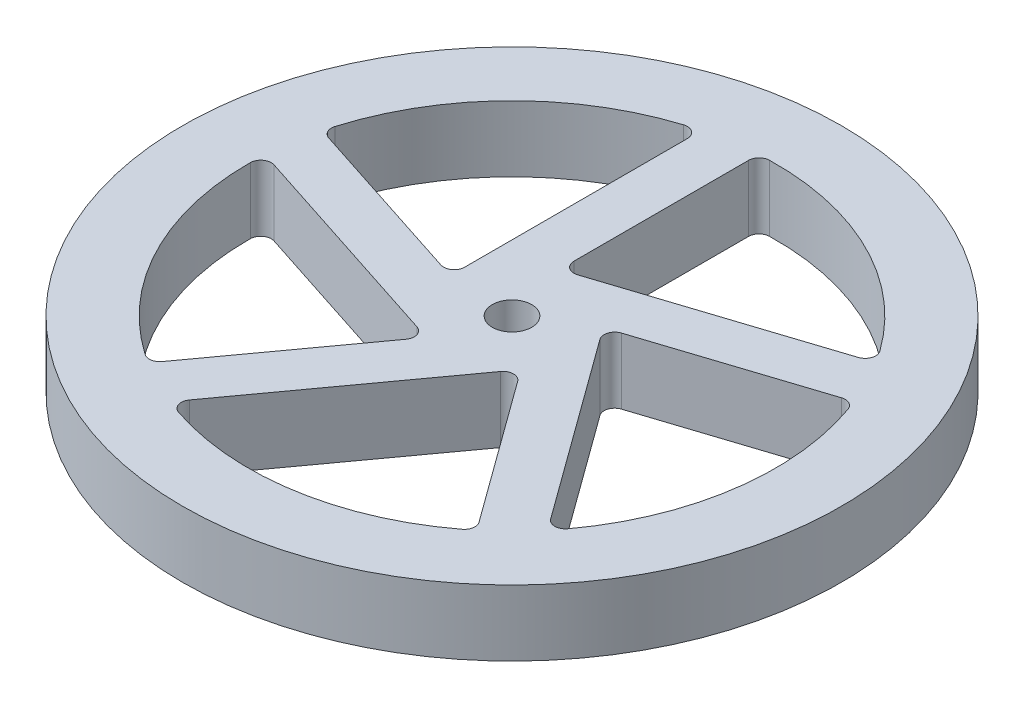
ISO-10303-21;
HEADER;
FILE_DESCRIPTION(('STEP AP214'),'2;1');
FILE_NAME('part.step','',(''),(''),'','','');
FILE_SCHEMA(('AUTOMOTIVE_DESIGN { 1 0 10303 214 1 1 1 1 }'));
ENDSEC;
DATA;
#1=APPLICATION_CONTEXT('core data for automotive mechanical design processes');
#2=APPLICATION_PROTOCOL_DEFINITION('international standard','automotive_design',2000,#1);
#3=PRODUCT_CONTEXT('',#1,'mechanical');
#4=PRODUCT('Part','Part','',(#3));
#5=PRODUCT_RELATED_PRODUCT_CATEGORY('part','',(#4));
#6=PRODUCT_DEFINITION_FORMATION('','',#4);
#7=PRODUCT_DEFINITION_CONTEXT('part definition',#1,'design');
#8=PRODUCT_DEFINITION('design','',#6,#7);
#9=PRODUCT_DEFINITION_SHAPE('','',#8);
#10=(LENGTH_UNIT() NAMED_UNIT(*) SI_UNIT(.MILLI.,.METRE.));
#11=(NAMED_UNIT(*) PLANE_ANGLE_UNIT() SI_UNIT($,.RADIAN.));
#12=(NAMED_UNIT(*) SI_UNIT($,.STERADIAN.) SOLID_ANGLE_UNIT());
#13=UNCERTAINTY_MEASURE_WITH_UNIT(LENGTH_MEASURE(1.E-05),#10,'distance_accuracy_value','');
#14=(GEOMETRIC_REPRESENTATION_CONTEXT(3) GLOBAL_UNCERTAINTY_ASSIGNED_CONTEXT((#13)) GLOBAL_UNIT_ASSIGNED_CONTEXT((#10,
#11,#12)) REPRESENTATION_CONTEXT('',''));
#15=CARTESIAN_POINT('',(0.,0.,0.));
#16=DIRECTION('',(0.,0.,1.));
#17=DIRECTION('',(1.,0.,0.));
#18=AXIS2_PLACEMENT_3D('',#15,#16,#17);
#19=CARTESIAN_POINT('',(0.,3.175,0.));
#20=DIRECTION('',(0.,-1.,0.));
#21=DIRECTION('',(0.,0.,-1.));
#22=AXIS2_PLACEMENT_3D('',#19,#20,#21);
#23=CYLINDRICAL_SURFACE('',#22,31.75);
#24=CARTESIAN_POINT('',(0.,3.175,0.));
#25=DIRECTION('',(0.,1.,0.));
#26=DIRECTION('',(0.,0.,1.));
#27=AXIS2_PLACEMENT_3D('',#24,#25,#26);
#28=CIRCLE('',#27,31.75);
#29=CARTESIAN_POINT('',(0.,3.175,31.75));
#30=VERTEX_POINT('',#29);
#31=EDGE_CURVE('E331',#30,#30,#28,.T.);
#32=ORIENTED_EDGE('',*,*,#31,.F.);
#33=EDGE_LOOP('',(#32));
#34=FACE_BOUND('',#33,.T.);
#35=CARTESIAN_POINT('',(0.,-3.175,0.));
#36=DIRECTION('',(0.,1.,0.));
#37=DIRECTION('',(0.,0.,1.));
#38=AXIS2_PLACEMENT_3D('',#35,#36,#37);
#39=CIRCLE('',#38,31.75);
#40=CARTESIAN_POINT('',(0.,-3.175,31.75));
#41=VERTEX_POINT('',#40);
#42=EDGE_CURVE('E336',#41,#41,#39,.T.);
#43=ORIENTED_EDGE('',*,*,#42,.T.);
#44=EDGE_LOOP('',(#43));
#45=FACE_BOUND('',#44,.T.);
#46=ADVANCED_FACE('F106',(#34,#45),#23,.T.);
#47=CARTESIAN_POINT('',(0.,3.175,0.));
#48=DIRECTION('',(0.,1.,0.));
#49=DIRECTION('',(0.,0.,1.));
#50=AXIS2_PLACEMENT_3D('',#47,#48,#49);
#51=PLANE('',#50);
#52=DIRECTION('',(-0.951056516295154,0.,-0.309016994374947));
#53=VECTOR('',#52,1.);
#54=CARTESIAN_POINT('',(-1.96225791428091,3.175,6.03920887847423));
#55=LINE('',#54,#53);
#56=CARTESIAN_POINT('',(-3.66697709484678,3.175,5.48531204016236));
#57=VERTEX_POINT('',#56);
#58=CARTESIAN_POINT('',(-24.0693922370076,3.175,-1.14383449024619));
#59=VERTEX_POINT('',#58);
#60=EDGE_CURVE('E884',#57,#59,#55,.T.);
#61=ORIENTED_EDGE('',*,*,#60,.F.);
#62=CARTESIAN_POINT('',(-3.98093836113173,3.175,6.45158546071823));
#63=DIRECTION('',(0.,1.,0.));
#64=DIRECTION('',(0.,0.,1.));
#65=AXIS2_PLACEMENT_3D('',#62,#63,#64);
#66=CIRCLE('',#65,1.016);
#67=CARTESIAN_POINT('',(-3.15897709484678,3.175,7.04877527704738));
#68=VERTEX_POINT('',#67);
#69=EDGE_CURVE('E129',#57,#68,#66,.F.);
#70=ORIENTED_EDGE('',*,*,#69,.T.);
#71=DIRECTION('',(-0.587785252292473,0.,0.809016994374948));
#72=VECTOR('',#71,1.);
#73=CARTESIAN_POINT('',(1.28431447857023,3.175,0.9331090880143));
#74=LINE('',#73,#72);
#75=CARTESIAN_POINT('',(-13.0443040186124,3.175,20.6547605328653));
#76=VERTEX_POINT('',#75);
#77=EDGE_CURVE('E883',#68,#76,#74,.T.);
#78=ORIENTED_EDGE('',*,*,#77,.T.);
#79=CARTESIAN_POINT('',(-13.8662652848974,3.175,20.0575707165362));
#80=DIRECTION('',(0.,1.,0.));
#81=DIRECTION('',(0.,0.,1.));
#82=AXIS2_PLACEMENT_3D('',#79,#80,#81);
#83=CIRCLE('',#82,1.016);
#84=CARTESIAN_POINT('',(-14.4440263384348,3.175,20.8933028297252));
#85=VERTEX_POINT('',#84);
#86=EDGE_CURVE('E443',#76,#85,#83,.F.);
#87=ORIENTED_EDGE('',*,*,#86,.T.);
#88=CARTESIAN_POINT('',(0.,3.175,0.));
#89=DIRECTION('',(0.,1.,0.));
#90=DIRECTION('',(0.,0.,1.));
#91=AXIS2_PLACEMENT_3D('',#88,#89,#90);
#92=CIRCLE('',#91,25.4);
#93=CARTESIAN_POINT('',(-25.3993265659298,3.175,-0.184959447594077));
#94=VERTEX_POINT('',#93);
#95=EDGE_CURVE('E879',#94,#85,#92,.T.);
#96=ORIENTED_EDGE('',*,*,#95,.F.);
#97=CARTESIAN_POINT('',(-24.3833535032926,3.175,-0.177561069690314));
#98=DIRECTION('',(0.,1.,0.));
#99=DIRECTION('',(0.,0.,1.));
#100=AXIS2_PLACEMENT_3D('',#97,#98,#99);
#101=CIRCLE('',#100,1.016);
#102=EDGE_CURVE('E121',#94,#59,#101,.F.);
#103=ORIENTED_EDGE('',*,*,#102,.T.);
#104=EDGE_LOOP('',(#61,#70,#78,#87,#96,#103));
#105=FACE_BOUND('',#104,.T.);
#106=DIRECTION('',(-0.587785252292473,0.,0.809016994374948));
#107=VECTOR('',#106,1.);
#108=CARTESIAN_POINT('',(5.13725791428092,3.175,3.7324363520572));
#109=LINE('',#108,#107);
#110=CARTESIAN_POINT('',(4.08368351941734,3.175,5.18255710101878));
#111=VERTEX_POINT('',#110);
#112=CARTESIAN_POINT('',(-8.52570249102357,3.175,22.5378880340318));
#113=VERTEX_POINT('',#112);
#114=EDGE_CURVE('E616',#111,#113,#109,.T.);
#115=ORIENTED_EDGE('',*,*,#114,.F.);
#116=CARTESIAN_POINT('',(4.90564478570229,3.175,5.77974691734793));
#117=DIRECTION('',(0.,1.,0.));
#118=DIRECTION('',(0.,0.,1.));
#119=AXIS2_PLACEMENT_3D('',#116,#117,#118);
#120=CIRCLE('',#119,1.016);
#121=CARTESIAN_POINT('',(5.72760605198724,3.175,5.18255710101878));
#122=VERTEX_POINT('',#121);
#123=EDGE_CURVE('E439',#111,#122,#120,.F.);
#124=ORIENTED_EDGE('',*,*,#123,.T.);
#125=DIRECTION('',(0.587785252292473,0.,0.809016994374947));
#126=VECTOR('',#125,1.);
#127=CARTESIAN_POINT('',(1.28431447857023,3.175,-0.933109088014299));
#128=LINE('',#127,#126);
#129=CARTESIAN_POINT('',(15.6129329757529,3.175,18.7885423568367));
#130=VERTEX_POINT('',#129);
#131=EDGE_CURVE('E606',#122,#130,#128,.T.);
#132=ORIENTED_EDGE('',*,*,#131,.T.);
#133=CARTESIAN_POINT('',(14.7909717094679,3.175,19.3857321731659));
#134=DIRECTION('',(0.,1.,0.));
#135=DIRECTION('',(0.,0.,1.));
#136=AXIS2_PLACEMENT_3D('',#133,#134,#135);
#137=CIRCLE('',#136,1.016);
#138=CARTESIAN_POINT('',(15.4072621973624,3.175,20.1934710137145));
#139=VERTEX_POINT('',#138);
#140=EDGE_CURVE('E453',#130,#139,#137,.F.);
#141=ORIENTED_EDGE('',*,*,#140,.T.);
#142=CARTESIAN_POINT('',(0.,3.175,0.));
#143=DIRECTION('',(0.,1.,0.));
#144=DIRECTION('',(0.,0.,1.));
#145=AXIS2_PLACEMENT_3D('',#142,#143,#144);
#146=CIRCLE('',#145,25.4);
#147=CARTESIAN_POINT('',(-8.02473044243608,3.175,24.0990394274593));
#148=VERTEX_POINT('',#147);
#149=EDGE_CURVE('E610',#148,#139,#146,.T.);
#150=ORIENTED_EDGE('',*,*,#149,.F.);
#151=CARTESIAN_POINT('',(-7.70374122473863,3.175,23.135077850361));
#152=DIRECTION('',(0.,1.,0.));
#153=DIRECTION('',(0.,0.,1.));
#154=AXIS2_PLACEMENT_3D('',#151,#152,#153);
#155=CIRCLE('',#154,1.016);
#156=EDGE_CURVE('E435',#148,#113,#155,.F.);
#157=ORIENTED_EDGE('',*,*,#156,.T.);
#158=EDGE_LOOP('',(#115,#124,#132,#141,#150,#157));
#159=FACE_BOUND('',#158,.T.);
#160=DIRECTION('',(0.587785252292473,0.,0.809016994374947));
#161=VECTOR('',#160,1.);
#162=CARTESIAN_POINT('',(5.13725791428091,3.175,-3.7324363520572));
#163=LINE('',#162,#161);
#164=CARTESIAN_POINT('',(6.19083230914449,3.175,-2.28231560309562));
#165=VERTEX_POINT('',#164);
#166=CARTESIAN_POINT('',(18.8002183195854,3.175,15.0730153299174));
#167=VERTEX_POINT('',#166);
#168=EDGE_CURVE('E622',#165,#167,#163,.T.);
#169=ORIENTED_EDGE('',*,*,#168,.F.);
#170=CARTESIAN_POINT('',(7.01279357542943,3.175,-2.87950541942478));
#171=DIRECTION('',(0.,1.,0.));
#172=DIRECTION('',(0.,0.,1.));
#173=AXIS2_PLACEMENT_3D('',#170,#171,#172);
#174=CIRCLE('',#173,1.016);
#175=CARTESIAN_POINT('',(6.69883230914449,3.175,-3.84577883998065));
#176=VERTEX_POINT('',#175);
#177=EDGE_CURVE('E431',#165,#176,#174,.F.);
#178=ORIENTED_EDGE('',*,*,#177,.T.);
#179=DIRECTION('',(0.951056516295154,0.,-0.309016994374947));
#180=VECTOR('',#179,1.);
#181=CARTESIAN_POINT('',(-0.490564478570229,3.175,-1.50980221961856));
#182=LINE('',#181,#180);
#183=CARTESIAN_POINT('',(22.6936272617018,3.175,-9.04280275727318));
#184=VERTEX_POINT('',#183);
#185=EDGE_CURVE('E627',#176,#184,#182,.T.);
#186=ORIENTED_EDGE('',*,*,#185,.T.);
#187=CARTESIAN_POINT('',(23.0075885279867,3.175,-8.0765293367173));
#188=DIRECTION('',(0.,1.,0.));
#189=DIRECTION('',(0.,0.,1.));
#190=AXIS2_PLACEMENT_3D('',#187,#188,#189);
#191=CIRCLE('',#190,1.016);
#192=CARTESIAN_POINT('',(23.9662380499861,3.175,-8.41305139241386));
#193=VERTEX_POINT('',#192);
#194=EDGE_CURVE('E423',#184,#193,#191,.F.);
#195=ORIENTED_EDGE('',*,*,#194,.T.);
#196=CARTESIAN_POINT('',(0.,3.175,0.));
#197=DIRECTION('',(0.,1.,0.));
#198=DIRECTION('',(0.,0.,1.));
#199=AXIS2_PLACEMENT_3D('',#196,#197,#198);
#200=CIRCLE('',#199,25.4);
#201=CARTESIAN_POINT('',(20.4397704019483,3.175,15.0789849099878));
#202=VERTEX_POINT('',#201);
#203=EDGE_CURVE('E632',#202,#193,#200,.T.);
#204=ORIENTED_EDGE('',*,*,#203,.F.);
#205=CARTESIAN_POINT('',(19.6221795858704,3.175,14.4758255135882));
#206=DIRECTION('',(0.,1.,0.));
#207=DIRECTION('',(0.,0.,1.));
#208=AXIS2_PLACEMENT_3D('',#205,#206,#207);
#209=CIRCLE('',#208,1.016);
#210=EDGE_CURVE('E427',#202,#167,#209,.F.);
#211=ORIENTED_EDGE('',*,*,#210,.T.);
#212=EDGE_LOOP('',(#169,#178,#186,#195,#204,#211));
#213=FACE_BOUND('',#212,.T.);
#214=DIRECTION('',(0.951056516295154,0.,-0.309016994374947));
#215=VECTOR('',#214,1.);
#216=CARTESIAN_POINT('',(-1.96225791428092,3.175,-6.03920887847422));
#217=LINE('',#216,#215);
#218=CARTESIAN_POINT('',(-0.257538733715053,3.175,-6.59310571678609));
#219=VERTEX_POINT('',#218);
#220=CARTESIAN_POINT('',(20.1448764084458,3.175,-13.2222522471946));
#221=VERTEX_POINT('',#220);
#222=EDGE_CURVE('E460',#219,#221,#217,.T.);
#223=ORIENTED_EDGE('',*,*,#222,.F.);
#224=CARTESIAN_POINT('',(-0.5715,3.175,-7.55937913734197));
#225=DIRECTION('',(0.,1.,0.));
#226=DIRECTION('',(0.,0.,1.));
#227=AXIS2_PLACEMENT_3D('',#224,#225,#226);
#228=CIRCLE('',#227,1.016);
#229=CARTESIAN_POINT('',(-1.5875,3.175,-7.55937913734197));
#230=VERTEX_POINT('',#229);
#231=EDGE_CURVE('E419',#219,#230,#228,.F.);
#232=ORIENTED_EDGE('',*,*,#231,.T.);
#233=DIRECTION('',(0.,0.,-1.));
#234=VECTOR('',#233,1.);
#235=CARTESIAN_POINT('',(-1.5875,3.175,0.));
#236=LINE('',#235,#234);
#237=CARTESIAN_POINT('',(-1.5875,3.175,-24.3773018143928));
#238=VERTEX_POINT('',#237);
#239=EDGE_CURVE('E491',#230,#238,#236,.T.);
#240=ORIENTED_EDGE('',*,*,#239,.T.);
#241=CARTESIAN_POINT('',(-0.5715,3.175,-24.3773018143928));
#242=DIRECTION('',(0.,1.,0.));
#243=DIRECTION('',(0.,0.,1.));
#244=AXIS2_PLACEMENT_3D('',#241,#242,#243);
#245=CIRCLE('',#244,1.016);
#246=CARTESIAN_POINT('',(-0.595312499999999,3.175,-25.3930227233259));
#247=VERTEX_POINT('',#246);
#248=EDGE_CURVE('E415',#238,#247,#245,.F.);
#249=ORIENTED_EDGE('',*,*,#248,.T.);
#250=CARTESIAN_POINT('',(0.,3.175,0.));
#251=DIRECTION('',(0.,1.,0.));
#252=DIRECTION('',(0.,0.,1.));
#253=AXIS2_PLACEMENT_3D('',#250,#251,#252);
#254=CIRCLE('',#253,25.4);
#255=CARTESIAN_POINT('',(20.6572032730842,3.175,-14.7797142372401));
#256=VERTEX_POINT('',#255);
#257=EDGE_CURVE('E462',#256,#247,#254,.T.);
#258=ORIENTED_EDGE('',*,*,#257,.F.);
#259=CARTESIAN_POINT('',(19.8309151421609,3.175,-14.1885256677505));
#260=DIRECTION('',(0.,1.,0.));
#261=DIRECTION('',(0.,0.,1.));
#262=AXIS2_PLACEMENT_3D('',#259,#260,#261);
#263=CIRCLE('',#262,1.016);
#264=EDGE_CURVE('E114',#256,#221,#263,.F.);
#265=ORIENTED_EDGE('',*,*,#264,.T.);
#266=EDGE_LOOP('',(#223,#232,#240,#249,#258,#265));
#267=FACE_BOUND('',#266,.T.);
#268=DIRECTION('',(0.,0.,-1.));
#269=VECTOR('',#268,1.);
#270=CARTESIAN_POINT('',(-6.35,3.175,0.));
#271=LINE('',#270,#269);
#272=CARTESIAN_POINT('',(-6.35,3.175,-1.79244782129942));
#273=VERTEX_POINT('',#272);
#274=CARTESIAN_POINT('',(-6.35,3.175,-23.2448166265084));
#275=VERTEX_POINT('',#274);
#276=EDGE_CURVE('E310',#273,#275,#271,.T.);
#277=ORIENTED_EDGE('',*,*,#276,.F.);
#278=CARTESIAN_POINT('',(-7.366,3.175,-1.79244782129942));
#279=DIRECTION('',(0.,1.,0.));
#280=DIRECTION('',(0.,0.,1.));
#281=AXIS2_PLACEMENT_3D('',#278,#279,#280);
#282=CIRCLE('',#281,1.016);
#283=CARTESIAN_POINT('',(-7.67996126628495,3.175,-0.82617440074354));
#284=VERTEX_POINT('',#283);
#285=EDGE_CURVE('E304',#273,#284,#282,.F.);
#286=ORIENTED_EDGE('',*,*,#285,.T.);
#287=DIRECTION('',(-0.951056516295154,0.,-0.309016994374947));
#288=VECTOR('',#287,1.);
#289=CARTESIAN_POINT('',(-0.490564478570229,3.175,1.50980221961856));
#290=LINE('',#289,#288);
#291=CARTESIAN_POINT('',(-23.6747562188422,3.175,-6.02319831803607));
#292=VERTEX_POINT('',#291);
#293=EDGE_CURVE('E308',#284,#292,#290,.T.);
#294=ORIENTED_EDGE('',*,*,#293,.T.);
#295=CARTESIAN_POINT('',(-23.3607949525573,3.175,-6.98947173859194));
#296=DIRECTION('',(0.,1.,0.));
#297=DIRECTION('',(0.,0.,1.));
#298=AXIS2_PLACEMENT_3D('',#295,#296,#297);
#299=CIRCLE('',#298,1.016);
#300=CARTESIAN_POINT('',(-24.3341614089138,3.175,-7.28069972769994));
#301=VERTEX_POINT('',#300);
#302=EDGE_CURVE('E407',#292,#301,#299,.F.);
#303=ORIENTED_EDGE('',*,*,#302,.T.);
#304=CARTESIAN_POINT('',(0.,3.175,0.));
#305=DIRECTION('',(0.,1.,0.));
#306=DIRECTION('',(0.,0.,1.));
#307=AXIS2_PLACEMENT_3D('',#304,#305,#306);
#308=CIRCLE('',#307,25.4);
#309=CARTESIAN_POINT('',(-7.67291666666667,3.175,-24.2133506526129));
#310=VERTEX_POINT('',#309);
#311=EDGE_CURVE('E327',#310,#301,#308,.T.);
#312=ORIENTED_EDGE('',*,*,#311,.F.);
#313=CARTESIAN_POINT('',(-7.366,3.175,-23.2448166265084));
#314=DIRECTION('',(0.,1.,0.));
#315=DIRECTION('',(0.,0.,1.));
#316=AXIS2_PLACEMENT_3D('',#313,#314,#315);
#317=CIRCLE('',#316,1.016);
#318=EDGE_CURVE('E411',#310,#275,#317,.F.);
#319=ORIENTED_EDGE('',*,*,#318,.T.);
#320=EDGE_LOOP('',(#277,#286,#294,#303,#312,#319));
#321=FACE_BOUND('',#320,.T.);
#322=CARTESIAN_POINT('',(0.,3.175,0.));
#323=DIRECTION('',(0.,1.,0.));
#324=DIRECTION('',(0.,0.,1.));
#325=AXIS2_PLACEMENT_3D('',#322,#323,#324);
#326=CIRCLE('',#325,1.89864999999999);
#327=CARTESIAN_POINT('',(0.,3.175,1.89864999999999));
#328=VERTEX_POINT('',#327);
#329=EDGE_CURVE('E502',#328,#328,#326,.T.);
#330=ORIENTED_EDGE('',*,*,#329,.F.);
#331=EDGE_LOOP('',(#330));
#332=FACE_BOUND('',#331,.T.);
#333=ORIENTED_EDGE('',*,*,#31,.T.);
#334=EDGE_LOOP('',(#333));
#335=FACE_BOUND('',#334,.T.);
#336=ADVANCED_FACE('F306',(#105,#159,#213,#267,#321,#332,#335),#51,.T.);
#337=CARTESIAN_POINT('',(0.,-3.175,0.));
#338=DIRECTION('',(0.,1.,0.));
#339=DIRECTION('',(0.,0.,1.));
#340=AXIS2_PLACEMENT_3D('',#337,#338,#339);
#341=PLANE('',#340);
#342=CARTESIAN_POINT('',(0.,-3.175,0.));
#343=DIRECTION('',(0.,1.,0.));
#344=DIRECTION('',(0.,0.,1.));
#345=AXIS2_PLACEMENT_3D('',#342,#343,#344);
#346=CIRCLE('',#345,25.4);
#347=CARTESIAN_POINT('',(-14.4440263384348,-3.175,20.8933028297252));
#348=VERTEX_POINT('',#347);
#349=CARTESIAN_POINT('',(-25.3993265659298,-3.175,-0.184959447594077));
#350=VERTEX_POINT('',#349);
#351=EDGE_CURVE('E613',#348,#350,#346,.F.);
#352=ORIENTED_EDGE('',*,*,#351,.F.);
#353=CARTESIAN_POINT('',(-13.8662652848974,-3.175,20.0575707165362));
#354=DIRECTION('',(0.,1.,0.));
#355=DIRECTION('',(0.,0.,1.));
#356=AXIS2_PLACEMENT_3D('',#353,#354,#355);
#357=CIRCLE('',#356,1.016);
#358=CARTESIAN_POINT('',(-13.0443040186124,-3.175,20.6547605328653));
#359=VERTEX_POINT('',#358);
#360=EDGE_CURVE('E445',#348,#359,#357,.T.);
#361=ORIENTED_EDGE('',*,*,#360,.T.);
#362=DIRECTION('',(0.587785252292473,0.,-0.809016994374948));
#363=VECTOR('',#362,1.);
#364=CARTESIAN_POINT('',(1.28431447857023,-3.175,0.9331090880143));
#365=LINE('',#364,#363);
#366=CARTESIAN_POINT('',(-3.15897709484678,-3.175,7.04877527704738));
#367=VERTEX_POINT('',#366);
#368=EDGE_CURVE('E890',#359,#367,#365,.T.);
#369=ORIENTED_EDGE('',*,*,#368,.T.);
#370=CARTESIAN_POINT('',(-3.98093836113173,-3.175,6.45158546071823));
#371=DIRECTION('',(0.,1.,0.));
#372=DIRECTION('',(0.,0.,1.));
#373=AXIS2_PLACEMENT_3D('',#370,#371,#372);
#374=CIRCLE('',#373,1.016);
#375=CARTESIAN_POINT('',(-3.66697709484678,-3.175,5.48531204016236));
#376=VERTEX_POINT('',#375);
#377=EDGE_CURVE('E451',#367,#376,#374,.T.);
#378=ORIENTED_EDGE('',*,*,#377,.T.);
#379=DIRECTION('',(0.951056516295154,0.,0.309016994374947));
#380=VECTOR('',#379,1.);
#381=CARTESIAN_POINT('',(-1.96225791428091,-3.175,6.03920887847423));
#382=LINE('',#381,#380);
#383=CARTESIAN_POINT('',(-24.0693922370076,-3.175,-1.14383449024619));
#384=VERTEX_POINT('',#383);
#385=EDGE_CURVE('E894',#384,#376,#382,.T.);
#386=ORIENTED_EDGE('',*,*,#385,.F.);
#387=CARTESIAN_POINT('',(-24.3833535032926,-3.175,-0.177561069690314));
#388=DIRECTION('',(0.,1.,0.));
#389=DIRECTION('',(0.,0.,1.));
#390=AXIS2_PLACEMENT_3D('',#387,#388,#389);
#391=CIRCLE('',#390,1.016);
#392=EDGE_CURVE('E448',#384,#350,#391,.T.);
#393=ORIENTED_EDGE('',*,*,#392,.T.);
#394=EDGE_LOOP('',(#352,#361,#369,#378,#386,#393));
#395=FACE_BOUND('',#394,.T.);
#396=CARTESIAN_POINT('',(0.,-3.175,0.));
#397=DIRECTION('',(0.,1.,0.));
#398=DIRECTION('',(0.,0.,1.));
#399=AXIS2_PLACEMENT_3D('',#396,#397,#398);
#400=CIRCLE('',#399,25.4);
#401=CARTESIAN_POINT('',(15.4072621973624,-3.175,20.1934710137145));
#402=VERTEX_POINT('',#401);
#403=CARTESIAN_POINT('',(-8.02473044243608,-3.175,24.0990394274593));
#404=VERTEX_POINT('',#403);
#405=EDGE_CURVE('E599',#402,#404,#400,.F.);
#406=ORIENTED_EDGE('',*,*,#405,.F.);
#407=CARTESIAN_POINT('',(14.7909717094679,-3.175,19.3857321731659));
#408=DIRECTION('',(0.,1.,0.));
#409=DIRECTION('',(0.,0.,1.));
#410=AXIS2_PLACEMENT_3D('',#407,#408,#409);
#411=CIRCLE('',#410,1.016);
#412=CARTESIAN_POINT('',(15.6129329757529,-3.175,18.7885423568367));
#413=VERTEX_POINT('',#412);
#414=EDGE_CURVE('E455',#402,#413,#411,.T.);
#415=ORIENTED_EDGE('',*,*,#414,.T.);
#416=DIRECTION('',(-0.587785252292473,0.,-0.809016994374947));
#417=VECTOR('',#416,1.);
#418=CARTESIAN_POINT('',(1.28431447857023,-3.175,-0.933109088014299));
#419=LINE('',#418,#417);
#420=CARTESIAN_POINT('',(5.72760605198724,-3.175,5.18255710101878));
#421=VERTEX_POINT('',#420);
#422=EDGE_CURVE('E596',#413,#421,#419,.T.);
#423=ORIENTED_EDGE('',*,*,#422,.T.);
#424=CARTESIAN_POINT('',(4.90564478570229,-3.175,5.77974691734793));
#425=DIRECTION('',(0.,1.,0.));
#426=DIRECTION('',(0.,0.,1.));
#427=AXIS2_PLACEMENT_3D('',#424,#425,#426);
#428=CIRCLE('',#427,1.016);
#429=CARTESIAN_POINT('',(4.08368351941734,-3.175,5.18255710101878));
#430=VERTEX_POINT('',#429);
#431=EDGE_CURVE('E441',#421,#430,#428,.T.);
#432=ORIENTED_EDGE('',*,*,#431,.T.);
#433=DIRECTION('',(0.587785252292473,0.,-0.809016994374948));
#434=VECTOR('',#433,1.);
#435=CARTESIAN_POINT('',(5.13725791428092,-3.175,3.7324363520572));
#436=LINE('',#435,#434);
#437=CARTESIAN_POINT('',(-8.52570249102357,-3.175,22.5378880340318));
#438=VERTEX_POINT('',#437);
#439=EDGE_CURVE('E605',#438,#430,#436,.T.);
#440=ORIENTED_EDGE('',*,*,#439,.F.);
#441=CARTESIAN_POINT('',(-7.70374122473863,-3.175,23.135077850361));
#442=DIRECTION('',(0.,1.,0.));
#443=DIRECTION('',(0.,0.,1.));
#444=AXIS2_PLACEMENT_3D('',#441,#442,#443);
#445=CIRCLE('',#444,1.016);
#446=EDGE_CURVE('E437',#438,#404,#445,.T.);
#447=ORIENTED_EDGE('',*,*,#446,.T.);
#448=EDGE_LOOP('',(#406,#415,#423,#432,#440,#447));
#449=FACE_BOUND('',#448,.T.);
#450=CARTESIAN_POINT('',(0.,-3.175,0.));
#451=DIRECTION('',(0.,1.,0.));
#452=DIRECTION('',(0.,0.,1.));
#453=AXIS2_PLACEMENT_3D('',#450,#451,#452);
#454=CIRCLE('',#453,25.4);
#455=CARTESIAN_POINT('',(23.9662380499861,-3.175,-8.41305139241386));
#456=VERTEX_POINT('',#455);
#457=CARTESIAN_POINT('',(20.4397704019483,-3.175,15.0789849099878));
#458=VERTEX_POINT('',#457);
#459=EDGE_CURVE('E471',#456,#458,#454,.F.);
#460=ORIENTED_EDGE('',*,*,#459,.F.);
#461=CARTESIAN_POINT('',(23.0075885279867,-3.175,-8.0765293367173));
#462=DIRECTION('',(0.,1.,0.));
#463=DIRECTION('',(0.,0.,1.));
#464=AXIS2_PLACEMENT_3D('',#461,#462,#463);
#465=CIRCLE('',#464,1.016);
#466=CARTESIAN_POINT('',(22.6936272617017,-3.175,-9.04280275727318));
#467=VERTEX_POINT('',#466);
#468=EDGE_CURVE('E425',#456,#467,#465,.T.);
#469=ORIENTED_EDGE('',*,*,#468,.T.);
#470=DIRECTION('',(-0.951056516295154,0.,0.309016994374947));
#471=VECTOR('',#470,1.);
#472=CARTESIAN_POINT('',(-0.490564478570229,-3.175,-1.50980221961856));
#473=LINE('',#472,#471);
#474=CARTESIAN_POINT('',(6.69883230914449,-3.175,-3.84577883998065));
#475=VERTEX_POINT('',#474);
#476=EDGE_CURVE('E623',#467,#475,#473,.T.);
#477=ORIENTED_EDGE('',*,*,#476,.T.);
#478=CARTESIAN_POINT('',(7.01279357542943,-3.175,-2.87950541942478));
#479=DIRECTION('',(0.,1.,0.));
#480=DIRECTION('',(0.,0.,1.));
#481=AXIS2_PLACEMENT_3D('',#478,#479,#480);
#482=CIRCLE('',#481,1.016);
#483=CARTESIAN_POINT('',(6.19083230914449,-3.175,-2.28231560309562));
#484=VERTEX_POINT('',#483);
#485=EDGE_CURVE('E433',#475,#484,#482,.T.);
#486=ORIENTED_EDGE('',*,*,#485,.T.);
#487=DIRECTION('',(-0.587785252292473,0.,-0.809016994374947));
#488=VECTOR('',#487,1.);
#489=CARTESIAN_POINT('',(5.13725791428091,-3.175,-3.7324363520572));
#490=LINE('',#489,#488);
#491=CARTESIAN_POINT('',(18.8002183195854,-3.175,15.0730153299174));
#492=VERTEX_POINT('',#491);
#493=EDGE_CURVE('E626',#492,#484,#490,.T.);
#494=ORIENTED_EDGE('',*,*,#493,.F.);
#495=CARTESIAN_POINT('',(19.6221795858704,-3.175,14.4758255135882));
#496=DIRECTION('',(0.,1.,0.));
#497=DIRECTION('',(0.,0.,1.));
#498=AXIS2_PLACEMENT_3D('',#495,#496,#497);
#499=CIRCLE('',#498,1.016);
#500=EDGE_CURVE('E429',#492,#458,#499,.T.);
#501=ORIENTED_EDGE('',*,*,#500,.T.);
#502=EDGE_LOOP('',(#460,#469,#477,#486,#494,#501));
#503=FACE_BOUND('',#502,.T.);
#504=CARTESIAN_POINT('',(0.,-3.175,0.));
#505=DIRECTION('',(0.,1.,0.));
#506=DIRECTION('',(0.,0.,1.));
#507=AXIS2_PLACEMENT_3D('',#504,#505,#506);
#508=CIRCLE('',#507,25.4);
#509=CARTESIAN_POINT('',(-0.595312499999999,-3.175,-25.3930227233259));
#510=VERTEX_POINT('',#509);
#511=CARTESIAN_POINT('',(20.6572032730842,-3.175,-14.7797142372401));
#512=VERTEX_POINT('',#511);
#513=EDGE_CURVE('E479',#510,#512,#508,.F.);
#514=ORIENTED_EDGE('',*,*,#513,.F.);
#515=CARTESIAN_POINT('',(-0.5715,-3.175,-24.3773018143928));
#516=DIRECTION('',(0.,1.,0.));
#517=DIRECTION('',(0.,0.,1.));
#518=AXIS2_PLACEMENT_3D('',#515,#516,#517);
#519=CIRCLE('',#518,1.016);
#520=CARTESIAN_POINT('',(-1.5875,-3.175,-24.3773018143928));
#521=VERTEX_POINT('',#520);
#522=EDGE_CURVE('E417',#510,#521,#519,.T.);
#523=ORIENTED_EDGE('',*,*,#522,.T.);
#524=DIRECTION('',(0.,0.,1.));
#525=VECTOR('',#524,1.);
#526=CARTESIAN_POINT('',(-1.5875,-3.175,0.));
#527=LINE('',#526,#525);
#528=CARTESIAN_POINT('',(-1.5875,-3.175,-7.55937913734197));
#529=VERTEX_POINT('',#528);
#530=EDGE_CURVE('E487',#521,#529,#527,.T.);
#531=ORIENTED_EDGE('',*,*,#530,.T.);
#532=CARTESIAN_POINT('',(-0.5715,-3.175,-7.55937913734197));
#533=DIRECTION('',(0.,1.,0.));
#534=DIRECTION('',(0.,0.,1.));
#535=AXIS2_PLACEMENT_3D('',#532,#533,#534);
#536=CIRCLE('',#535,1.016);
#537=CARTESIAN_POINT('',(-0.257538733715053,-3.175,-6.59310571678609));
#538=VERTEX_POINT('',#537);
#539=EDGE_CURVE('E421',#529,#538,#536,.T.);
#540=ORIENTED_EDGE('',*,*,#539,.T.);
#541=DIRECTION('',(-0.951056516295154,0.,0.309016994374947));
#542=VECTOR('',#541,1.);
#543=CARTESIAN_POINT('',(-1.96225791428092,-3.175,-6.03920887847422));
#544=LINE('',#543,#542);
#545=CARTESIAN_POINT('',(20.1448764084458,-3.175,-13.2222522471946));
#546=VERTEX_POINT('',#545);
#547=EDGE_CURVE('E481',#546,#538,#544,.T.);
#548=ORIENTED_EDGE('',*,*,#547,.F.);
#549=CARTESIAN_POINT('',(19.8309151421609,-3.175,-14.1885256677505));
#550=DIRECTION('',(0.,1.,0.));
#551=DIRECTION('',(0.,0.,1.));
#552=AXIS2_PLACEMENT_3D('',#549,#550,#551);
#553=CIRCLE('',#552,1.016);
#554=EDGE_CURVE('E12',#546,#512,#553,.T.);
#555=ORIENTED_EDGE('',*,*,#554,.T.);
#556=EDGE_LOOP('',(#514,#523,#531,#540,#548,#555));
#557=FACE_BOUND('',#556,.T.);
#558=CARTESIAN_POINT('',(0.,-3.175,0.));
#559=DIRECTION('',(0.,1.,0.));
#560=DIRECTION('',(0.,0.,1.));
#561=AXIS2_PLACEMENT_3D('',#558,#559,#560);
#562=CIRCLE('',#561,25.4);
#563=CARTESIAN_POINT('',(-24.3341614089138,-3.175,-7.28069972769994));
#564=VERTEX_POINT('',#563);
#565=CARTESIAN_POINT('',(-7.67291666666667,-3.175,-24.2133506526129));
#566=VERTEX_POINT('',#565);
#567=EDGE_CURVE('E496',#564,#566,#562,.F.);
#568=ORIENTED_EDGE('',*,*,#567,.F.);
#569=CARTESIAN_POINT('',(-23.3607949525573,-3.175,-6.98947173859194));
#570=DIRECTION('',(0.,1.,0.));
#571=DIRECTION('',(0.,0.,1.));
#572=AXIS2_PLACEMENT_3D('',#569,#570,#571);
#573=CIRCLE('',#572,1.016);
#574=CARTESIAN_POINT('',(-23.6747562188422,-3.175,-6.02319831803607));
#575=VERTEX_POINT('',#574);
#576=EDGE_CURVE('E409',#564,#575,#573,.T.);
#577=ORIENTED_EDGE('',*,*,#576,.T.);
#578=DIRECTION('',(0.951056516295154,0.,0.309016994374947));
#579=VECTOR('',#578,1.);
#580=CARTESIAN_POINT('',(-0.490564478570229,-3.175,1.50980221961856));
#581=LINE('',#580,#579);
#582=CARTESIAN_POINT('',(-7.67996126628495,-3.175,-0.826174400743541));
#583=VERTEX_POINT('',#582);
#584=EDGE_CURVE('E326',#575,#583,#581,.T.);
#585=ORIENTED_EDGE('',*,*,#584,.T.);
#586=CARTESIAN_POINT('',(-7.366,-3.175,-1.79244782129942));
#587=DIRECTION('',(0.,1.,0.));
#588=DIRECTION('',(0.,0.,1.));
#589=AXIS2_PLACEMENT_3D('',#586,#587,#588);
#590=CIRCLE('',#589,1.016);
#591=CARTESIAN_POINT('',(-6.35,-3.175,-1.79244782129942));
#592=VERTEX_POINT('',#591);
#593=EDGE_CURVE('E315',#583,#592,#590,.T.);
#594=ORIENTED_EDGE('',*,*,#593,.T.);
#595=DIRECTION('',(0.,0.,1.));
#596=VECTOR('',#595,1.);
#597=CARTESIAN_POINT('',(-6.35,-3.175,0.));
#598=LINE('',#597,#596);
#599=CARTESIAN_POINT('',(-6.35,-3.175,-23.2448166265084));
#600=VERTEX_POINT('',#599);
#601=EDGE_CURVE('E494',#600,#592,#598,.T.);
#602=ORIENTED_EDGE('',*,*,#601,.F.);
#603=CARTESIAN_POINT('',(-7.366,-3.175,-23.2448166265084));
#604=DIRECTION('',(0.,1.,0.));
#605=DIRECTION('',(0.,0.,1.));
#606=AXIS2_PLACEMENT_3D('',#603,#604,#605);
#607=CIRCLE('',#606,1.016);
#608=EDGE_CURVE('E316',#600,#566,#607,.T.);
#609=ORIENTED_EDGE('',*,*,#608,.T.);
#610=EDGE_LOOP('',(#568,#577,#585,#594,#602,#609));
#611=FACE_BOUND('',#610,.T.);
#612=CARTESIAN_POINT('',(0.,-3.175,0.));
#613=DIRECTION('',(0.,1.,0.));
#614=DIRECTION('',(0.,0.,1.));
#615=AXIS2_PLACEMENT_3D('',#612,#613,#614);
#616=CIRCLE('',#615,1.89864999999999);
#617=CARTESIAN_POINT('',(0.,-3.175,1.89864999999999));
#618=VERTEX_POINT('',#617);
#619=EDGE_CURVE('E505',#618,#618,#616,.T.);
#620=ORIENTED_EDGE('',*,*,#619,.T.);
#621=EDGE_LOOP('',(#620));
#622=FACE_BOUND('',#621,.T.);
#623=ORIENTED_EDGE('',*,*,#42,.F.);
#624=EDGE_LOOP('',(#623));
#625=FACE_BOUND('',#624,.T.);
#626=ADVANCED_FACE('F477',(#395,#449,#503,#557,#611,#622,#625),#341,.F.);
#627=CARTESIAN_POINT('',(0.,3.175,0.));
#628=DIRECTION('',(0.,1.,0.));
#629=DIRECTION('',(0.,0.,1.));
#630=AXIS2_PLACEMENT_3D('',#627,#628,#629);
#631=CYLINDRICAL_SURFACE('',#630,1.89864999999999);
#632=ORIENTED_EDGE('',*,*,#619,.F.);
#633=EDGE_LOOP('',(#632));
#634=FACE_BOUND('',#633,.T.);
#635=ORIENTED_EDGE('',*,*,#329,.T.);
#636=EDGE_LOOP('',(#635));
#637=FACE_BOUND('',#636,.T.);
#638=ADVANCED_FACE('F514',(#634,#637),#631,.F.);
#639=CARTESIAN_POINT('',(-6.35,-36.434395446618,0.));
#640=DIRECTION('',(1.,0.,0.));
#641=DIRECTION('',(0.,0.,-1.));
#642=AXIS2_PLACEMENT_3D('',#639,#640,#641);
#643=PLANE('',#642);
#644=ORIENTED_EDGE('',*,*,#276,.T.);
#645=DIRECTION('',(0.,-1.,0.));
#646=VECTOR('',#645,1.);
#647=CARTESIAN_POINT('',(-6.35,-3.175,-23.2448166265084));
#648=LINE('',#647,#646);
#649=EDGE_CURVE('E346',#275,#600,#648,.T.);
#650=ORIENTED_EDGE('',*,*,#649,.T.);
#651=ORIENTED_EDGE('',*,*,#601,.T.);
#652=DIRECTION('',(0.,1.,0.));
#653=VECTOR('',#652,1.);
#654=CARTESIAN_POINT('',(-6.35,-36.434395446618,-1.79244782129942));
#655=LINE('',#654,#653);
#656=EDGE_CURVE('E344',#592,#273,#655,.T.);
#657=ORIENTED_EDGE('',*,*,#656,.T.);
#658=EDGE_LOOP('',(#644,#650,#651,#657));
#659=FACE_BOUND('',#658,.T.);
#660=ADVANCED_FACE('F521',(#659),#643,.F.);
#661=CARTESIAN_POINT('',(-0.490564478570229,-36.434395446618,1.50980221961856));
#662=DIRECTION('',(0.309016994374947,0.,-0.951056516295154));
#663=DIRECTION('',(-0.951056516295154,0.,-0.309016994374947));
#664=AXIS2_PLACEMENT_3D('',#661,#662,#663);
#665=PLANE('',#664);
#666=ORIENTED_EDGE('',*,*,#584,.F.);
#667=DIRECTION('',(0.,1.,0.));
#668=VECTOR('',#667,1.);
#669=CARTESIAN_POINT('',(-23.6747562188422,-36.434395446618,-6.02319831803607));
#670=LINE('',#669,#668);
#671=EDGE_CURVE('E325',#575,#292,#670,.T.);
#672=ORIENTED_EDGE('',*,*,#671,.T.);
#673=ORIENTED_EDGE('',*,*,#293,.F.);
#674=DIRECTION('',(0.,1.,0.));
#675=VECTOR('',#674,1.);
#676=CARTESIAN_POINT('',(-7.67996126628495,-36.434395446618,-0.826174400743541));
#677=LINE('',#676,#675);
#678=EDGE_CURVE('E322',#284,#583,#677,.F.);
#679=ORIENTED_EDGE('',*,*,#678,.T.);
#680=EDGE_LOOP('',(#666,#672,#673,#679));
#681=FACE_BOUND('',#680,.T.);
#682=ADVANCED_FACE('F321',(#681),#665,.T.);
#683=CARTESIAN_POINT('',(0.,-36.434395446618,0.));
#684=DIRECTION('',(0.,1.,0.));
#685=DIRECTION('',(0.,0.,1.));
#686=AXIS2_PLACEMENT_3D('',#683,#684,#685);
#687=CYLINDRICAL_SURFACE('',#686,25.4);
#688=ORIENTED_EDGE('',*,*,#311,.T.);
#689=DIRECTION('',(0.,1.,0.));
#690=VECTOR('',#689,1.);
#691=CARTESIAN_POINT('',(-24.3341614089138,-36.434395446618,-7.28069972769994));
#692=LINE('',#691,#690);
#693=EDGE_CURVE('E342',#301,#564,#692,.F.);
#694=ORIENTED_EDGE('',*,*,#693,.T.);
#695=ORIENTED_EDGE('',*,*,#567,.T.);
#696=DIRECTION('',(0.,1.,0.));
#697=VECTOR('',#696,1.);
#698=CARTESIAN_POINT('',(-7.67291666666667,-36.434395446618,-24.2133506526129));
#699=LINE('',#698,#697);
#700=EDGE_CURVE('E333',#566,#310,#699,.T.);
#701=ORIENTED_EDGE('',*,*,#700,.T.);
#702=EDGE_LOOP('',(#688,#694,#695,#701));
#703=FACE_BOUND('',#702,.T.);
#704=ADVANCED_FACE('F656',(#703),#687,.F.);
#705=CARTESIAN_POINT('',(-1.96225791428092,-36.434395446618,-6.03920887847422));
#706=DIRECTION('',(0.309016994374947,0.,0.951056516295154));
#707=DIRECTION('',(0.951056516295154,0.,-0.309016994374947));
#708=AXIS2_PLACEMENT_3D('',#705,#706,#707);
#709=PLANE('',#708);
#710=ORIENTED_EDGE('',*,*,#547,.T.);
#711=DIRECTION('',(0.,1.,0.));
#712=VECTOR('',#711,1.);
#713=CARTESIAN_POINT('',(-0.257538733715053,-36.434395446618,-6.59310571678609));
#714=LINE('',#713,#712);
#715=EDGE_CURVE('E360',#538,#219,#714,.T.);
#716=ORIENTED_EDGE('',*,*,#715,.T.);
#717=ORIENTED_EDGE('',*,*,#222,.T.);
#718=DIRECTION('',(0.,-1.,0.));
#719=VECTOR('',#718,1.);
#720=CARTESIAN_POINT('',(20.1448764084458,-3.175,-13.2222522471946));
#721=LINE('',#720,#719);
#722=EDGE_CURVE('E358',#221,#546,#721,.T.);
#723=ORIENTED_EDGE('',*,*,#722,.T.);
#724=EDGE_LOOP('',(#710,#716,#717,#723));
#725=FACE_BOUND('',#724,.T.);
#726=ADVANCED_FACE('F468',(#725),#709,.F.);
#727=CARTESIAN_POINT('',(-1.5875,-36.434395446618,0.));
#728=DIRECTION('',(1.,0.,0.));
#729=DIRECTION('',(0.,0.,-1.));
#730=AXIS2_PLACEMENT_3D('',#727,#728,#729);
#731=PLANE('',#730);
#732=ORIENTED_EDGE('',*,*,#530,.F.);
#733=DIRECTION('',(0.,1.,0.));
#734=VECTOR('',#733,1.);
#735=CARTESIAN_POINT('',(-1.5875,-36.434395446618,-24.3773018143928));
#736=LINE('',#735,#734);
#737=EDGE_CURVE('E350',#521,#238,#736,.T.);
#738=ORIENTED_EDGE('',*,*,#737,.T.);
#739=ORIENTED_EDGE('',*,*,#239,.F.);
#740=DIRECTION('',(0.,1.,0.));
#741=VECTOR('',#740,1.);
#742=CARTESIAN_POINT('',(-1.5875,-36.434395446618,-7.55937913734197));
#743=LINE('',#742,#741);
#744=EDGE_CURVE('E348',#230,#529,#743,.F.);
#745=ORIENTED_EDGE('',*,*,#744,.T.);
#746=EDGE_LOOP('',(#732,#738,#739,#745));
#747=FACE_BOUND('',#746,.T.);
#748=ADVANCED_FACE('F645',(#747),#731,.T.);
#749=CARTESIAN_POINT('',(0.,-36.434395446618,0.));
#750=DIRECTION('',(0.,1.,0.));
#751=DIRECTION('',(0.,0.,1.));
#752=AXIS2_PLACEMENT_3D('',#749,#750,#751);
#753=CYLINDRICAL_SURFACE('',#752,25.4);
#754=ORIENTED_EDGE('',*,*,#257,.T.);
#755=DIRECTION('',(0.,1.,0.));
#756=VECTOR('',#755,1.);
#757=CARTESIAN_POINT('',(-0.5953125,-36.434395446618,-25.3930227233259));
#758=LINE('',#757,#756);
#759=EDGE_CURVE('E356',#247,#510,#758,.F.);
#760=ORIENTED_EDGE('',*,*,#759,.T.);
#761=ORIENTED_EDGE('',*,*,#513,.T.);
#762=DIRECTION('',(0.,1.,0.));
#763=VECTOR('',#762,1.);
#764=CARTESIAN_POINT('',(20.6572032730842,-36.434395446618,-14.7797142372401));
#765=LINE('',#764,#763);
#766=EDGE_CURVE('E353',#512,#256,#765,.T.);
#767=ORIENTED_EDGE('',*,*,#766,.T.);
#768=EDGE_LOOP('',(#754,#760,#761,#767));
#769=FACE_BOUND('',#768,.T.);
#770=ADVANCED_FACE('F483',(#769),#753,.F.);
#771=CARTESIAN_POINT('',(5.13725791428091,-36.434395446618,-3.7324363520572));
#772=DIRECTION('',(-0.809016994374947,0.,0.587785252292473));
#773=DIRECTION('',(0.587785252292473,0.,0.809016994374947));
#774=AXIS2_PLACEMENT_3D('',#771,#772,#773);
#775=PLANE('',#774);
#776=ORIENTED_EDGE('',*,*,#168,.T.);
#777=DIRECTION('',(0.,-1.,0.));
#778=VECTOR('',#777,1.);
#779=CARTESIAN_POINT('',(18.8002183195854,-3.175,15.0730153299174));
#780=LINE('',#779,#778);
#781=EDGE_CURVE('E376',#167,#492,#780,.T.);
#782=ORIENTED_EDGE('',*,*,#781,.T.);
#783=ORIENTED_EDGE('',*,*,#493,.T.);
#784=DIRECTION('',(0.,1.,0.));
#785=VECTOR('',#784,1.);
#786=CARTESIAN_POINT('',(6.19083230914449,-36.434395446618,-2.28231560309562));
#787=LINE('',#786,#785);
#788=EDGE_CURVE('E373',#484,#165,#787,.T.);
#789=ORIENTED_EDGE('',*,*,#788,.T.);
#790=EDGE_LOOP('',(#776,#782,#783,#789));
#791=FACE_BOUND('',#790,.T.);
#792=ADVANCED_FACE('F654',(#791),#775,.F.);
#793=CARTESIAN_POINT('',(-0.490564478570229,-36.434395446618,-1.50980221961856));
#794=DIRECTION('',(0.309016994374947,0.,0.951056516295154));
#795=DIRECTION('',(0.951056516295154,0.,-0.309016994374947));
#796=AXIS2_PLACEMENT_3D('',#793,#794,#795);
#797=PLANE('',#796);
#798=ORIENTED_EDGE('',*,*,#476,.F.);
#799=DIRECTION('',(0.,1.,0.));
#800=VECTOR('',#799,1.);
#801=CARTESIAN_POINT('',(22.6936272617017,-36.434395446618,-9.04280275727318));
#802=LINE('',#801,#800);
#803=EDGE_CURVE('E365',#467,#184,#802,.T.);
#804=ORIENTED_EDGE('',*,*,#803,.T.);
#805=ORIENTED_EDGE('',*,*,#185,.F.);
#806=DIRECTION('',(0.,1.,0.));
#807=VECTOR('',#806,1.);
#808=CARTESIAN_POINT('',(6.69883230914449,-36.434395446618,-3.84577883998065));
#809=LINE('',#808,#807);
#810=EDGE_CURVE('E363',#176,#475,#809,.F.);
#811=ORIENTED_EDGE('',*,*,#810,.T.);
#812=EDGE_LOOP('',(#798,#804,#805,#811));
#813=FACE_BOUND('',#812,.T.);
#814=ADVANCED_FACE('F711',(#813),#797,.T.);
#815=CARTESIAN_POINT('',(0.,-36.434395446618,0.));
#816=DIRECTION('',(0.,1.,0.));
#817=DIRECTION('',(0.,0.,1.));
#818=AXIS2_PLACEMENT_3D('',#815,#816,#817);
#819=CYLINDRICAL_SURFACE('',#818,25.4);
#820=ORIENTED_EDGE('',*,*,#203,.T.);
#821=DIRECTION('',(0.,1.,0.));
#822=VECTOR('',#821,1.);
#823=CARTESIAN_POINT('',(23.9662380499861,-36.434395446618,-8.41305139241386));
#824=LINE('',#823,#822);
#825=EDGE_CURVE('E371',#193,#456,#824,.F.);
#826=ORIENTED_EDGE('',*,*,#825,.T.);
#827=ORIENTED_EDGE('',*,*,#459,.T.);
#828=DIRECTION('',(0.,1.,0.));
#829=VECTOR('',#828,1.);
#830=CARTESIAN_POINT('',(20.4397704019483,-36.434395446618,15.0789849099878));
#831=LINE('',#830,#829);
#832=EDGE_CURVE('E368',#458,#202,#831,.T.);
#833=ORIENTED_EDGE('',*,*,#832,.T.);
#834=EDGE_LOOP('',(#820,#826,#827,#833));
#835=FACE_BOUND('',#834,.T.);
#836=ADVANCED_FACE('F720',(#835),#819,.F.);
#837=CARTESIAN_POINT('',(5.13725791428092,-36.434395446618,3.7324363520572));
#838=DIRECTION('',(-0.809016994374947,0.,-0.587785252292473));
#839=DIRECTION('',(-0.587785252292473,0.,0.809016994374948));
#840=AXIS2_PLACEMENT_3D('',#837,#838,#839);
#841=PLANE('',#840);
#842=ORIENTED_EDGE('',*,*,#114,.T.);
#843=DIRECTION('',(0.,-1.,0.));
#844=VECTOR('',#843,1.);
#845=CARTESIAN_POINT('',(-8.52570249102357,-3.175,22.5378880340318));
#846=LINE('',#845,#844);
#847=EDGE_CURVE('E386',#113,#438,#846,.T.);
#848=ORIENTED_EDGE('',*,*,#847,.T.);
#849=ORIENTED_EDGE('',*,*,#439,.T.);
#850=DIRECTION('',(0.,1.,0.));
#851=VECTOR('',#850,1.);
#852=CARTESIAN_POINT('',(4.08368351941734,-36.434395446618,5.18255710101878));
#853=LINE('',#852,#851);
#854=EDGE_CURVE('E383',#430,#111,#853,.T.);
#855=ORIENTED_EDGE('',*,*,#854,.T.);
#856=EDGE_LOOP('',(#842,#848,#849,#855));
#857=FACE_BOUND('',#856,.T.);
#858=ADVANCED_FACE('F730',(#857),#841,.F.);
#859=CARTESIAN_POINT('',(1.28431447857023,-36.434395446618,-0.933109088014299));
#860=DIRECTION('',(-0.809016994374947,0.,0.587785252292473));
#861=DIRECTION('',(0.587785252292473,0.,0.809016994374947));
#862=AXIS2_PLACEMENT_3D('',#859,#860,#861);
#863=PLANE('',#862);
#864=ORIENTED_EDGE('',*,*,#131,.F.);
#865=DIRECTION('',(0.,1.,0.));
#866=VECTOR('',#865,1.);
#867=CARTESIAN_POINT('',(5.72760605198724,-36.434395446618,5.18255710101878));
#868=LINE('',#867,#866);
#869=EDGE_CURVE('E391',#122,#421,#868,.F.);
#870=ORIENTED_EDGE('',*,*,#869,.T.);
#871=ORIENTED_EDGE('',*,*,#422,.F.);
#872=DIRECTION('',(0.,1.,0.));
#873=VECTOR('',#872,1.);
#874=CARTESIAN_POINT('',(15.6129329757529,-36.434395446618,18.7885423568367));
#875=LINE('',#874,#873);
#876=EDGE_CURVE('E388',#413,#130,#875,.T.);
#877=ORIENTED_EDGE('',*,*,#876,.T.);
#878=EDGE_LOOP('',(#864,#870,#871,#877));
#879=FACE_BOUND('',#878,.T.);
#880=ADVANCED_FACE('F602',(#879),#863,.T.);
#881=CARTESIAN_POINT('',(0.,-36.434395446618,0.));
#882=DIRECTION('',(0.,1.,0.));
#883=DIRECTION('',(0.,0.,1.));
#884=AXIS2_PLACEMENT_3D('',#881,#882,#883);
#885=CYLINDRICAL_SURFACE('',#884,25.4);
#886=ORIENTED_EDGE('',*,*,#405,.T.);
#887=DIRECTION('',(0.,1.,0.));
#888=VECTOR('',#887,1.);
#889=CARTESIAN_POINT('',(-8.02473044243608,-36.434395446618,24.0990394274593));
#890=LINE('',#889,#888);
#891=EDGE_CURVE('E380',#404,#148,#890,.T.);
#892=ORIENTED_EDGE('',*,*,#891,.T.);
#893=ORIENTED_EDGE('',*,*,#149,.T.);
#894=DIRECTION('',(0.,1.,0.));
#895=VECTOR('',#894,1.);
#896=CARTESIAN_POINT('',(15.4072621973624,-36.434395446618,20.1934710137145));
#897=LINE('',#896,#895);
#898=EDGE_CURVE('E378',#139,#402,#897,.F.);
#899=ORIENTED_EDGE('',*,*,#898,.T.);
#900=EDGE_LOOP('',(#886,#892,#893,#899));
#901=FACE_BOUND('',#900,.T.);
#902=ADVANCED_FACE('F748',(#901),#885,.F.);
#903=CARTESIAN_POINT('',(-1.96225791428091,-36.434395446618,6.03920887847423));
#904=DIRECTION('',(0.309016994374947,0.,-0.951056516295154));
#905=DIRECTION('',(-0.951056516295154,0.,-0.309016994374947));
#906=AXIS2_PLACEMENT_3D('',#903,#904,#905);
#907=PLANE('',#906);
#908=ORIENTED_EDGE('',*,*,#60,.T.);
#909=DIRECTION('',(0.,-1.,0.));
#910=VECTOR('',#909,1.);
#911=CARTESIAN_POINT('',(-24.0693922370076,-3.175,-1.14383449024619));
#912=LINE('',#911,#910);
#913=EDGE_CURVE('E405',#59,#384,#912,.T.);
#914=ORIENTED_EDGE('',*,*,#913,.T.);
#915=ORIENTED_EDGE('',*,*,#385,.T.);
#916=DIRECTION('',(0.,1.,0.));
#917=VECTOR('',#916,1.);
#918=CARTESIAN_POINT('',(-3.66697709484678,-36.434395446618,5.48531204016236));
#919=LINE('',#918,#917);
#920=EDGE_CURVE('E403',#376,#57,#919,.T.);
#921=ORIENTED_EDGE('',*,*,#920,.T.);
#922=EDGE_LOOP('',(#908,#914,#915,#921));
#923=FACE_BOUND('',#922,.T.);
#924=ADVANCED_FACE('F757',(#923),#907,.F.);
#925=CARTESIAN_POINT('',(1.28431447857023,-36.434395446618,0.9331090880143));
#926=DIRECTION('',(-0.809016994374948,0.,-0.587785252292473));
#927=DIRECTION('',(-0.587785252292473,0.,0.809016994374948));
#928=AXIS2_PLACEMENT_3D('',#925,#926,#927);
#929=PLANE('',#928);
#930=ORIENTED_EDGE('',*,*,#368,.F.);
#931=DIRECTION('',(0.,1.,0.));
#932=VECTOR('',#931,1.);
#933=CARTESIAN_POINT('',(-13.0443040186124,-36.434395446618,20.6547605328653));
#934=LINE('',#933,#932);
#935=EDGE_CURVE('E395',#359,#76,#934,.T.);
#936=ORIENTED_EDGE('',*,*,#935,.T.);
#937=ORIENTED_EDGE('',*,*,#77,.F.);
#938=DIRECTION('',(0.,1.,0.));
#939=VECTOR('',#938,1.);
#940=CARTESIAN_POINT('',(-3.15897709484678,-36.434395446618,7.04877527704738));
#941=LINE('',#940,#939);
#942=EDGE_CURVE('E393',#68,#367,#941,.F.);
#943=ORIENTED_EDGE('',*,*,#942,.T.);
#944=EDGE_LOOP('',(#930,#936,#937,#943));
#945=FACE_BOUND('',#944,.T.);
#946=ADVANCED_FACE('F767',(#945),#929,.T.);
#947=CARTESIAN_POINT('',(0.,-36.434395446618,0.));
#948=DIRECTION('',(0.,1.,0.));
#949=DIRECTION('',(0.,0.,1.));
#950=AXIS2_PLACEMENT_3D('',#947,#948,#949);
#951=CYLINDRICAL_SURFACE('',#950,25.4);
#952=ORIENTED_EDGE('',*,*,#95,.T.);
#953=DIRECTION('',(0.,1.,0.));
#954=VECTOR('',#953,1.);
#955=CARTESIAN_POINT('',(-14.4440263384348,-36.434395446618,20.8933028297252));
#956=LINE('',#955,#954);
#957=EDGE_CURVE('E401',#85,#348,#956,.F.);
#958=ORIENTED_EDGE('',*,*,#957,.T.);
#959=ORIENTED_EDGE('',*,*,#351,.T.);
#960=DIRECTION('',(0.,1.,0.));
#961=VECTOR('',#960,1.);
#962=CARTESIAN_POINT('',(-25.3993265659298,-36.434395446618,-0.184959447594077));
#963=LINE('',#962,#961);
#964=EDGE_CURVE('E398',#350,#94,#963,.T.);
#965=ORIENTED_EDGE('',*,*,#964,.T.);
#966=EDGE_LOOP('',(#952,#958,#959,#965));
#967=FACE_BOUND('',#966,.T.);
#968=ADVANCED_FACE('F538',(#967),#951,.F.);
#969=CARTESIAN_POINT('',(-23.3607949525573,-36.434395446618,-6.98947173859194));
#970=DIRECTION('',(0.,1.,0.));
#971=DIRECTION('',(0.,0.,1.));
#972=AXIS2_PLACEMENT_3D('',#969,#970,#971);
#973=CYLINDRICAL_SURFACE('',#972,1.016);
#974=ORIENTED_EDGE('',*,*,#576,.F.);
#975=ORIENTED_EDGE('',*,*,#693,.F.);
#976=ORIENTED_EDGE('',*,*,#302,.F.);
#977=ORIENTED_EDGE('',*,*,#671,.F.);
#978=EDGE_LOOP('',(#974,#975,#976,#977));
#979=FACE_BOUND('',#978,.T.);
#980=ADVANCED_FACE('F534',(#979),#973,.F.);
#981=CARTESIAN_POINT('',(-7.366,-36.434395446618,-23.2448166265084));
#982=DIRECTION('',(0.,1.,0.));
#983=DIRECTION('',(0.,0.,1.));
#984=AXIS2_PLACEMENT_3D('',#981,#982,#983);
#985=CYLINDRICAL_SURFACE('',#984,1.016);
#986=ORIENTED_EDGE('',*,*,#608,.F.);
#987=ORIENTED_EDGE('',*,*,#649,.F.);
#988=ORIENTED_EDGE('',*,*,#318,.F.);
#989=ORIENTED_EDGE('',*,*,#700,.F.);
#990=EDGE_LOOP('',(#986,#987,#988,#989));
#991=FACE_BOUND('',#990,.T.);
#992=ADVANCED_FACE('F537',(#991),#985,.F.);
#993=CARTESIAN_POINT('',(-7.366,-36.434395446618,-1.79244782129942));
#994=DIRECTION('',(0.,1.,0.));
#995=DIRECTION('',(0.,0.,1.));
#996=AXIS2_PLACEMENT_3D('',#993,#994,#995);
#997=CYLINDRICAL_SURFACE('',#996,1.016);
#998=ORIENTED_EDGE('',*,*,#593,.F.);
#999=ORIENTED_EDGE('',*,*,#678,.F.);
#1000=ORIENTED_EDGE('',*,*,#285,.F.);
#1001=ORIENTED_EDGE('',*,*,#656,.F.);
#1002=EDGE_LOOP('',(#998,#999,#1000,#1001));
#1003=FACE_BOUND('',#1002,.T.);
#1004=ADVANCED_FACE('F330',(#1003),#997,.F.);
#1005=CARTESIAN_POINT('',(-0.5715,-36.434395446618,-24.3773018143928));
#1006=DIRECTION('',(0.,1.,0.));
#1007=DIRECTION('',(0.,0.,1.));
#1008=AXIS2_PLACEMENT_3D('',#1005,#1006,#1007);
#1009=CYLINDRICAL_SURFACE('',#1008,1.016);
#1010=ORIENTED_EDGE('',*,*,#522,.F.);
#1011=ORIENTED_EDGE('',*,*,#759,.F.);
#1012=ORIENTED_EDGE('',*,*,#248,.F.);
#1013=ORIENTED_EDGE('',*,*,#737,.F.);
#1014=EDGE_LOOP('',(#1010,#1011,#1012,#1013));
#1015=FACE_BOUND('',#1014,.T.);
#1016=ADVANCED_FACE('F545',(#1015),#1009,.F.);
#1017=CARTESIAN_POINT('',(-0.5715,-36.434395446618,-7.55937913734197));
#1018=DIRECTION('',(0.,1.,0.));
#1019=DIRECTION('',(0.,0.,1.));
#1020=AXIS2_PLACEMENT_3D('',#1017,#1018,#1019);
#1021=CYLINDRICAL_SURFACE('',#1020,1.016);
#1022=ORIENTED_EDGE('',*,*,#539,.F.);
#1023=ORIENTED_EDGE('',*,*,#744,.F.);
#1024=ORIENTED_EDGE('',*,*,#231,.F.);
#1025=ORIENTED_EDGE('',*,*,#715,.F.);
#1026=EDGE_LOOP('',(#1022,#1023,#1024,#1025));
#1027=FACE_BOUND('',#1026,.T.);
#1028=ADVANCED_FACE('F548',(#1027),#1021,.F.);
#1029=CARTESIAN_POINT('',(23.0075885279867,-36.434395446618,-8.0765293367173));
#1030=DIRECTION('',(0.,1.,0.));
#1031=DIRECTION('',(0.,0.,1.));
#1032=AXIS2_PLACEMENT_3D('',#1029,#1030,#1031);
#1033=CYLINDRICAL_SURFACE('',#1032,1.016);
#1034=ORIENTED_EDGE('',*,*,#468,.F.);
#1035=ORIENTED_EDGE('',*,*,#825,.F.);
#1036=ORIENTED_EDGE('',*,*,#194,.F.);
#1037=ORIENTED_EDGE('',*,*,#803,.F.);
#1038=EDGE_LOOP('',(#1034,#1035,#1036,#1037));
#1039=FACE_BOUND('',#1038,.T.);
#1040=ADVANCED_FACE('F552',(#1039),#1033,.F.);
#1041=CARTESIAN_POINT('',(19.6221795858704,-36.434395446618,14.4758255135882));
#1042=DIRECTION('',(0.,1.,0.));
#1043=DIRECTION('',(0.,0.,1.));
#1044=AXIS2_PLACEMENT_3D('',#1041,#1042,#1043);
#1045=CYLINDRICAL_SURFACE('',#1044,1.016);
#1046=ORIENTED_EDGE('',*,*,#500,.F.);
#1047=ORIENTED_EDGE('',*,*,#781,.F.);
#1048=ORIENTED_EDGE('',*,*,#210,.F.);
#1049=ORIENTED_EDGE('',*,*,#832,.F.);
#1050=EDGE_LOOP('',(#1046,#1047,#1048,#1049));
#1051=FACE_BOUND('',#1050,.T.);
#1052=ADVANCED_FACE('F556',(#1051),#1045,.F.);
#1053=CARTESIAN_POINT('',(7.01279357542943,-36.434395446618,-2.87950541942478));
#1054=DIRECTION('',(0.,1.,0.));
#1055=DIRECTION('',(0.,0.,1.));
#1056=AXIS2_PLACEMENT_3D('',#1053,#1054,#1055);
#1057=CYLINDRICAL_SURFACE('',#1056,1.016);
#1058=ORIENTED_EDGE('',*,*,#485,.F.);
#1059=ORIENTED_EDGE('',*,*,#810,.F.);
#1060=ORIENTED_EDGE('',*,*,#177,.F.);
#1061=ORIENTED_EDGE('',*,*,#788,.F.);
#1062=EDGE_LOOP('',(#1058,#1059,#1060,#1061));
#1063=FACE_BOUND('',#1062,.T.);
#1064=ADVANCED_FACE('F560',(#1063),#1057,.F.);
#1065=CARTESIAN_POINT('',(-7.70374122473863,-36.434395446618,23.135077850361));
#1066=DIRECTION('',(0.,1.,0.));
#1067=DIRECTION('',(0.,0.,1.));
#1068=AXIS2_PLACEMENT_3D('',#1065,#1066,#1067);
#1069=CYLINDRICAL_SURFACE('',#1068,1.016);
#1070=ORIENTED_EDGE('',*,*,#446,.F.);
#1071=ORIENTED_EDGE('',*,*,#847,.F.);
#1072=ORIENTED_EDGE('',*,*,#156,.F.);
#1073=ORIENTED_EDGE('',*,*,#891,.F.);
#1074=EDGE_LOOP('',(#1070,#1071,#1072,#1073));
#1075=FACE_BOUND('',#1074,.T.);
#1076=ADVANCED_FACE('F564',(#1075),#1069,.F.);
#1077=CARTESIAN_POINT('',(4.90564478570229,-36.434395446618,5.77974691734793));
#1078=DIRECTION('',(0.,1.,0.));
#1079=DIRECTION('',(0.,0.,1.));
#1080=AXIS2_PLACEMENT_3D('',#1077,#1078,#1079);
#1081=CYLINDRICAL_SURFACE('',#1080,1.016);
#1082=ORIENTED_EDGE('',*,*,#431,.F.);
#1083=ORIENTED_EDGE('',*,*,#869,.F.);
#1084=ORIENTED_EDGE('',*,*,#123,.F.);
#1085=ORIENTED_EDGE('',*,*,#854,.F.);
#1086=EDGE_LOOP('',(#1082,#1083,#1084,#1085));
#1087=FACE_BOUND('',#1086,.T.);
#1088=ADVANCED_FACE('F568',(#1087),#1081,.F.);
#1089=CARTESIAN_POINT('',(-13.8662652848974,-36.434395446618,20.0575707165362));
#1090=DIRECTION('',(0.,1.,0.));
#1091=DIRECTION('',(0.,0.,1.));
#1092=AXIS2_PLACEMENT_3D('',#1089,#1090,#1091);
#1093=CYLINDRICAL_SURFACE('',#1092,1.016);
#1094=ORIENTED_EDGE('',*,*,#360,.F.);
#1095=ORIENTED_EDGE('',*,*,#957,.F.);
#1096=ORIENTED_EDGE('',*,*,#86,.F.);
#1097=ORIENTED_EDGE('',*,*,#935,.F.);
#1098=EDGE_LOOP('',(#1094,#1095,#1096,#1097));
#1099=FACE_BOUND('',#1098,.T.);
#1100=ADVANCED_FACE('F572',(#1099),#1093,.F.);
#1101=CARTESIAN_POINT('',(-24.3833535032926,-36.434395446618,-0.177561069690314));
#1102=DIRECTION('',(0.,1.,0.));
#1103=DIRECTION('',(0.,0.,1.));
#1104=AXIS2_PLACEMENT_3D('',#1101,#1102,#1103);
#1105=CYLINDRICAL_SURFACE('',#1104,1.016);
#1106=ORIENTED_EDGE('',*,*,#392,.F.);
#1107=ORIENTED_EDGE('',*,*,#913,.F.);
#1108=ORIENTED_EDGE('',*,*,#102,.F.);
#1109=ORIENTED_EDGE('',*,*,#964,.F.);
#1110=EDGE_LOOP('',(#1106,#1107,#1108,#1109));
#1111=FACE_BOUND('',#1110,.T.);
#1112=ADVANCED_FACE('F576',(#1111),#1105,.F.);
#1113=CARTESIAN_POINT('',(-3.98093836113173,-36.434395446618,6.45158546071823));
#1114=DIRECTION('',(0.,1.,0.));
#1115=DIRECTION('',(0.,0.,1.));
#1116=AXIS2_PLACEMENT_3D('',#1113,#1114,#1115);
#1117=CYLINDRICAL_SURFACE('',#1116,1.016);
#1118=ORIENTED_EDGE('',*,*,#377,.F.);
#1119=ORIENTED_EDGE('',*,*,#942,.F.);
#1120=ORIENTED_EDGE('',*,*,#69,.F.);
#1121=ORIENTED_EDGE('',*,*,#920,.F.);
#1122=EDGE_LOOP('',(#1118,#1119,#1120,#1121));
#1123=FACE_BOUND('',#1122,.T.);
#1124=ADVANCED_FACE('F580',(#1123),#1117,.F.);
#1125=CARTESIAN_POINT('',(14.7909717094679,-36.434395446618,19.3857321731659));
#1126=DIRECTION('',(0.,1.,0.));
#1127=DIRECTION('',(0.,0.,1.));
#1128=AXIS2_PLACEMENT_3D('',#1125,#1126,#1127);
#1129=CYLINDRICAL_SURFACE('',#1128,1.016);
#1130=ORIENTED_EDGE('',*,*,#414,.F.);
#1131=ORIENTED_EDGE('',*,*,#898,.F.);
#1132=ORIENTED_EDGE('',*,*,#140,.F.);
#1133=ORIENTED_EDGE('',*,*,#876,.F.);
#1134=EDGE_LOOP('',(#1130,#1131,#1132,#1133));
#1135=FACE_BOUND('',#1134,.T.);
#1136=ADVANCED_FACE('F583',(#1135),#1129,.F.);
#1137=CARTESIAN_POINT('',(19.8309151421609,-36.434395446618,-14.1885256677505));
#1138=DIRECTION('',(0.,1.,0.));
#1139=DIRECTION('',(0.,0.,1.));
#1140=AXIS2_PLACEMENT_3D('',#1137,#1138,#1139);
#1141=CYLINDRICAL_SURFACE('',#1140,1.016);
#1142=ORIENTED_EDGE('',*,*,#554,.F.);
#1143=ORIENTED_EDGE('',*,*,#722,.F.);
#1144=ORIENTED_EDGE('',*,*,#264,.F.);
#1145=ORIENTED_EDGE('',*,*,#766,.F.);
#1146=EDGE_LOOP('',(#1142,#1143,#1144,#1145));
#1147=FACE_BOUND('',#1146,.T.);
#1148=ADVANCED_FACE('F108',(#1147),#1141,.F.);
#1149=CLOSED_SHELL('',(#46,#336,#626,#638,#660,#682,#704,#726,#748,#770,#792,#814,#836,#858,
#880,#902,#924,#946,#968,#980,#992,#1004,#1016,#1028,#1040,#1052,#1064,#1076,#1088,#1100,#1112,
#1124,#1136,#1148));
#1150=MANIFOLD_SOLID_BREP('B2',#1149);
#1151=ADVANCED_BREP_SHAPE_REPRESENTATION('',(#18,#1150),#14);
#1152=SHAPE_DEFINITION_REPRESENTATION(#9,#1151);
ENDSEC;
END-ISO-10303-21;
